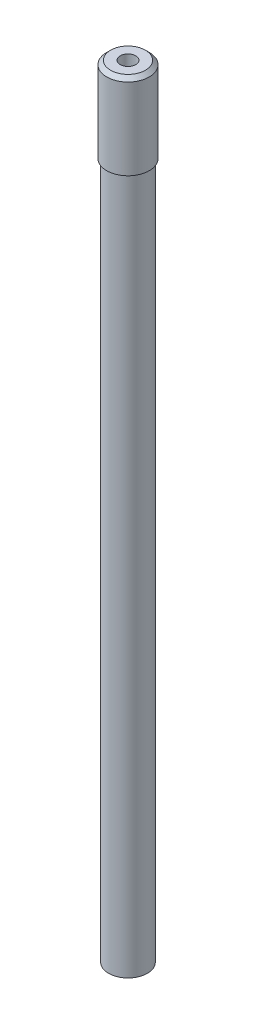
ISO-10303-21;
HEADER;
FILE_DESCRIPTION(('STEP AP214'),'2;1');
FILE_NAME('part.step','',(''),(''),'','','');
FILE_SCHEMA(('AUTOMOTIVE_DESIGN { 1 0 10303 214 1 1 1 1 }'));
ENDSEC;
DATA;
#1=APPLICATION_CONTEXT('core data for automotive mechanical design processes');
#2=APPLICATION_PROTOCOL_DEFINITION('international standard','automotive_design',2000,#1);
#3=PRODUCT_CONTEXT('',#1,'mechanical');
#4=PRODUCT('Part','Part','',(#3));
#5=PRODUCT_RELATED_PRODUCT_CATEGORY('part','',(#4));
#6=PRODUCT_DEFINITION_FORMATION('','',#4);
#7=PRODUCT_DEFINITION_CONTEXT('part definition',#1,'design');
#8=PRODUCT_DEFINITION('design','',#6,#7);
#9=PRODUCT_DEFINITION_SHAPE('','',#8);
#10=(LENGTH_UNIT() NAMED_UNIT(*) SI_UNIT(.MILLI.,.METRE.));
#11=(NAMED_UNIT(*) PLANE_ANGLE_UNIT() SI_UNIT($,.RADIAN.));
#12=(NAMED_UNIT(*) SI_UNIT($,.STERADIAN.) SOLID_ANGLE_UNIT());
#13=UNCERTAINTY_MEASURE_WITH_UNIT(LENGTH_MEASURE(1.E-05),#10,'distance_accuracy_value','');
#14=(GEOMETRIC_REPRESENTATION_CONTEXT(3) GLOBAL_UNCERTAINTY_ASSIGNED_CONTEXT((#13)) GLOBAL_UNIT_ASSIGNED_CONTEXT((#10,
#11,#12)) REPRESENTATION_CONTEXT('',''));
#15=CARTESIAN_POINT('',(0.,0.,0.));
#16=DIRECTION('',(0.,0.,1.));
#17=DIRECTION('',(1.,0.,0.));
#18=AXIS2_PLACEMENT_3D('',#15,#16,#17);
#19=CARTESIAN_POINT('',(0.,0.,0.));
#20=DIRECTION('',(0.,1.,0.));
#21=DIRECTION('',(0.,0.,1.));
#22=AXIS2_PLACEMENT_3D('',#19,#20,#21);
#23=PLANE('',#22);
#24=CARTESIAN_POINT('',(0.,0.,0.));
#25=DIRECTION('',(0.,1.,0.));
#26=DIRECTION('',(0.,0.,1.));
#27=AXIS2_PLACEMENT_3D('',#24,#25,#26);
#28=CIRCLE('',#27,2.75);
#29=CARTESIAN_POINT('',(0.,0.,2.75));
#30=VERTEX_POINT('',#29);
#31=EDGE_CURVE('E45',#30,#30,#28,.T.);
#32=ORIENTED_EDGE('',*,*,#31,.F.);
#33=EDGE_LOOP('',(#32));
#34=FACE_BOUND('',#33,.T.);
#35=CARTESIAN_POINT('',(0.,0.,0.));
#36=DIRECTION('',(0.,1.,0.));
#37=DIRECTION('',(0.,0.,1.));
#38=AXIS2_PLACEMENT_3D('',#35,#36,#37);
#39=CIRCLE('',#38,2.5);
#40=CARTESIAN_POINT('',(0.,0.,2.5));
#41=VERTEX_POINT('',#40);
#42=EDGE_CURVE('E10',#41,#41,#39,.F.);
#43=ORIENTED_EDGE('',*,*,#42,.F.);
#44=EDGE_LOOP('',(#43));
#45=FACE_BOUND('',#44,.T.);
#46=ADVANCED_FACE('F30',(#34,#45),#23,.F.);
#47=CARTESIAN_POINT('',(0.,11.,0.));
#48=DIRECTION('',(0.,-1.,0.));
#49=DIRECTION('',(0.,0.,-1.));
#50=AXIS2_PLACEMENT_3D('',#47,#48,#49);
#51=CYLINDRICAL_SURFACE('',#50,2.75);
#52=CARTESIAN_POINT('',(0.,10.5,0.));
#53=DIRECTION('',(0.,1.,0.));
#54=DIRECTION('',(0.,0.,1.));
#55=AXIS2_PLACEMENT_3D('',#52,#53,#54);
#56=CIRCLE('',#55,2.75);
#57=CARTESIAN_POINT('',(0.,10.5,2.75));
#58=VERTEX_POINT('',#57);
#59=EDGE_CURVE('E37',#58,#58,#56,.F.);
#60=ORIENTED_EDGE('',*,*,#59,.T.);
#61=EDGE_LOOP('',(#60));
#62=FACE_BOUND('',#61,.T.);
#63=ORIENTED_EDGE('',*,*,#31,.T.);
#64=EDGE_LOOP('',(#63));
#65=FACE_BOUND('',#64,.T.);
#66=ADVANCED_FACE('F72',(#62,#65),#51,.T.);
#67=CARTESIAN_POINT('',(0.,11.,0.));
#68=DIRECTION('',(0.,1.,0.));
#69=DIRECTION('',(0.,0.,1.));
#70=AXIS2_PLACEMENT_3D('',#67,#68,#69);
#71=PLANE('',#70);
#72=CARTESIAN_POINT('',(0.,11.,0.));
#73=DIRECTION('',(0.,1.,0.));
#74=DIRECTION('',(0.,0.,1.));
#75=AXIS2_PLACEMENT_3D('',#72,#73,#74);
#76=CIRCLE('',#75,1.);
#77=CARTESIAN_POINT('',(0.,11.,1.));
#78=VERTEX_POINT('',#77);
#79=EDGE_CURVE('E54',#78,#78,#76,.T.);
#80=ORIENTED_EDGE('',*,*,#79,.F.);
#81=EDGE_LOOP('',(#80));
#82=FACE_BOUND('',#81,.T.);
#83=CARTESIAN_POINT('',(0.,11.,0.));
#84=DIRECTION('',(0.,1.,0.));
#85=DIRECTION('',(0.,0.,1.));
#86=AXIS2_PLACEMENT_3D('',#83,#84,#85);
#87=CIRCLE('',#86,2.25);
#88=CARTESIAN_POINT('',(0.,11.,2.25));
#89=VERTEX_POINT('',#88);
#90=EDGE_CURVE('E41',#89,#89,#87,.T.);
#91=ORIENTED_EDGE('',*,*,#90,.T.);
#92=EDGE_LOOP('',(#91));
#93=FACE_BOUND('',#92,.T.);
#94=ADVANCED_FACE('F69',(#82,#93),#71,.T.);
#95=CARTESIAN_POINT('',(0.,11.,0.));
#96=DIRECTION('',(0.,-1.,0.));
#97=DIRECTION('',(0.,0.,-1.));
#98=AXIS2_PLACEMENT_3D('',#95,#96,#97);
#99=CONICAL_SURFACE('',#98,2.25,0.785398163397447);
#100=ORIENTED_EDGE('',*,*,#59,.F.);
#101=EDGE_LOOP('',(#100));
#102=FACE_BOUND('',#101,.T.);
#103=ORIENTED_EDGE('',*,*,#90,.F.);
#104=EDGE_LOOP('',(#103));
#105=FACE_BOUND('',#104,.T.);
#106=ADVANCED_FACE('F32',(#102,#105),#99,.T.);
#107=CARTESIAN_POINT('',(0.,-90.,0.));
#108=DIRECTION('',(0.,1.,0.));
#109=DIRECTION('',(0.,0.,1.));
#110=AXIS2_PLACEMENT_3D('',#107,#108,#109);
#111=CYLINDRICAL_SURFACE('',#110,2.5);
#112=CARTESIAN_POINT('',(0.,-90.,0.));
#113=DIRECTION('',(0.,-1.,0.));
#114=DIRECTION('',(0.,0.,-1.));
#115=AXIS2_PLACEMENT_3D('',#112,#113,#114);
#116=CIRCLE('',#115,2.5);
#117=CARTESIAN_POINT('',(0.,-90.,2.5));
#118=VERTEX_POINT('',#117);
#119=EDGE_CURVE('E50',#118,#118,#116,.T.);
#120=CARTESIAN_POINT('',(0.,-90.,2.5));
#121=CARTESIAN_POINT('',(0.,-89.0625,2.5));
#122=CARTESIAN_POINT('',(0.,-88.125,2.5));
#123=CARTESIAN_POINT('',(0.,-86.25,2.5));
#124=CARTESIAN_POINT('',(0.,-85.3125,2.5));
#125=CARTESIAN_POINT('',(0.,-83.4375,2.5));
#126=CARTESIAN_POINT('',(0.,-82.5,2.5));
#127=CARTESIAN_POINT('',(0.,-80.625,2.5));
#128=CARTESIAN_POINT('',(0.,-79.6875,2.5));
#129=CARTESIAN_POINT('',(0.,-77.8125,2.5));
#130=CARTESIAN_POINT('',(0.,-76.875,2.5));
#131=CARTESIAN_POINT('',(0.,-75.,2.5));
#132=CARTESIAN_POINT('',(0.,-74.0625,2.5));
#133=CARTESIAN_POINT('',(0.,-72.1875,2.5));
#134=CARTESIAN_POINT('',(0.,-71.25,2.5));
#135=CARTESIAN_POINT('',(0.,-69.375,2.5));
#136=CARTESIAN_POINT('',(0.,-68.4375,2.5));
#137=CARTESIAN_POINT('',(0.,-66.5625,2.5));
#138=CARTESIAN_POINT('',(0.,-65.625,2.5));
#139=CARTESIAN_POINT('',(0.,-63.75,2.5));
#140=CARTESIAN_POINT('',(0.,-62.8125,2.5));
#141=CARTESIAN_POINT('',(0.,-60.9375,2.5));
#142=CARTESIAN_POINT('',(0.,-60.,2.5));
#143=CARTESIAN_POINT('',(0.,-58.125,2.5));
#144=CARTESIAN_POINT('',(0.,-57.1875,2.5));
#145=CARTESIAN_POINT('',(0.,-55.3125,2.5));
#146=CARTESIAN_POINT('',(0.,-54.375,2.5));
#147=CARTESIAN_POINT('',(0.,-52.5,2.5));
#148=CARTESIAN_POINT('',(0.,-51.5625,2.5));
#149=CARTESIAN_POINT('',(0.,-49.6875,2.5));
#150=CARTESIAN_POINT('',(0.,-48.75,2.5));
#151=CARTESIAN_POINT('',(0.,-46.875,2.5));
#152=CARTESIAN_POINT('',(0.,-45.9375,2.5));
#153=CARTESIAN_POINT('',(0.,-44.0625,2.5));
#154=CARTESIAN_POINT('',(0.,-43.125,2.5));
#155=CARTESIAN_POINT('',(0.,-41.25,2.5));
#156=CARTESIAN_POINT('',(0.,-40.3125,2.5));
#157=CARTESIAN_POINT('',(0.,-38.4375,2.5));
#158=CARTESIAN_POINT('',(0.,-37.5,2.5));
#159=CARTESIAN_POINT('',(0.,-35.625,2.5));
#160=CARTESIAN_POINT('',(0.,-34.6875,2.5));
#161=CARTESIAN_POINT('',(0.,-32.8125,2.5));
#162=CARTESIAN_POINT('',(0.,-31.875,2.5));
#163=CARTESIAN_POINT('',(0.,-30.,2.5));
#164=CARTESIAN_POINT('',(0.,-29.0625,2.5));
#165=CARTESIAN_POINT('',(0.,-27.1875,2.5));
#166=CARTESIAN_POINT('',(0.,-26.25,2.5));
#167=CARTESIAN_POINT('',(0.,-24.375,2.5));
#168=CARTESIAN_POINT('',(0.,-23.4375,2.5));
#169=CARTESIAN_POINT('',(0.,-21.5625,2.5));
#170=CARTESIAN_POINT('',(0.,-20.625,2.5));
#171=CARTESIAN_POINT('',(0.,-18.75,2.5));
#172=CARTESIAN_POINT('',(0.,-17.8125,2.5));
#173=CARTESIAN_POINT('',(0.,-15.9375,2.5));
#174=CARTESIAN_POINT('',(0.,-15.,2.5));
#175=CARTESIAN_POINT('',(0.,-13.125,2.5));
#176=CARTESIAN_POINT('',(0.,-12.1875,2.5));
#177=CARTESIAN_POINT('',(0.,-10.3125,2.5));
#178=CARTESIAN_POINT('',(0.,-9.37500000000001,2.5));
#179=CARTESIAN_POINT('',(0.,-7.50000000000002,2.5));
#180=CARTESIAN_POINT('',(0.,-6.56250000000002,2.5));
#181=CARTESIAN_POINT('',(0.,-4.68750000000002,2.5));
#182=CARTESIAN_POINT('',(0.,-3.75000000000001,2.5));
#183=CARTESIAN_POINT('',(0.,-1.87500000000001,2.5));
#184=CARTESIAN_POINT('',(0.,-0.937500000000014,2.5));
#185=CARTESIAN_POINT('',(0.,0.,2.5));
#186=B_SPLINE_CURVE_WITH_KNOTS('',3,(#120,#121,#122,#123,#124,#125,#126,#127,#128,#129,#130,
#131,#132,#133,#134,#135,#136,#137,#138,#139,#140,#141,#142,#143,#144,#145,#146,#147,#148,#149,
#150,#151,#152,#153,#154,#155,#156,#157,#158,#159,#160,#161,#162,#163,#164,#165,#166,#167,#168,
#169,#170,#171,#172,#173,#174,#175,#176,#177,#178,#179,#180,#181,#182,#183,#184,#185),
.UNSPECIFIED.,.F.,.F.,(4,2,2,2,2,2,2,2,2,2,2,2,2,2,2,2,2,2,2,2,2,2,2,2,2,2,2,2,2,2,2,2,4),(0.,
2.81250000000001,5.62500000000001,8.4375,11.25,14.0625,16.875,19.6875,22.5,25.3125,28.125,
30.9375,33.75,36.5625,39.375,42.1875,45.,47.8125,50.625,53.4375,56.25,59.0625,61.875,64.6875,
67.5,70.3125,73.125,75.9375,78.75,81.5625,84.375,87.1875,90.),.UNSPECIFIED.);
#187=EDGE_CURVE('BSEAM77',#118,#41,#186,.T.);
#188=ORIENTED_EDGE('',*,*,#119,.F.);
#189=ORIENTED_EDGE('',*,*,#42,.T.);
#190=ORIENTED_EDGE('',*,*,#187,.T.);
#191=ORIENTED_EDGE('',*,*,#187,.F.);
#192=EDGE_LOOP('',(#188,#190,#189,#191));
#193=FACE_BOUND('',#192,.T.);
#194=ADVANCED_FACE('F77',(#193),#111,.T.);
#195=CARTESIAN_POINT('',(0.,-90.,0.));
#196=DIRECTION('',(0.,-1.,0.));
#197=DIRECTION('',(0.,0.,-1.));
#198=AXIS2_PLACEMENT_3D('',#195,#196,#197);
#199=PLANE('',#198);
#200=CARTESIAN_POINT('',(0.,-90.,0.));
#201=DIRECTION('',(0.,1.,0.));
#202=DIRECTION('',(0.,0.,1.));
#203=AXIS2_PLACEMENT_3D('',#200,#201,#202);
#204=CIRCLE('',#203,1.);
#205=CARTESIAN_POINT('',(0.,-90.,1.));
#206=VERTEX_POINT('',#205);
#207=EDGE_CURVE('E53',#206,#206,#204,.T.);
#208=ORIENTED_EDGE('',*,*,#207,.T.);
#209=EDGE_LOOP('',(#208));
#210=FACE_BOUND('',#209,.T.);
#211=ORIENTED_EDGE('',*,*,#119,.T.);
#212=EDGE_LOOP('',(#211));
#213=FACE_BOUND('',#212,.T.);
#214=ADVANCED_FACE('F60',(#210,#213),#199,.T.);
#215=CARTESIAN_POINT('',(0.,-90.,0.));
#216=DIRECTION('',(0.,1.,0.));
#217=DIRECTION('',(0.,0.,1.));
#218=AXIS2_PLACEMENT_3D('',#215,#216,#217);
#219=CYLINDRICAL_SURFACE('',#218,1.);
#220=CARTESIAN_POINT('',(0.,-90.,1.));
#221=CARTESIAN_POINT('',(0.,-88.9479166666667,1.));
#222=CARTESIAN_POINT('',(0.,-87.8958333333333,1.));
#223=CARTESIAN_POINT('',(0.,-85.7916666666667,1.));
#224=CARTESIAN_POINT('',(0.,-84.7395833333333,1.));
#225=CARTESIAN_POINT('',(0.,-82.6354166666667,1.));
#226=CARTESIAN_POINT('',(0.,-81.5833333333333,1.));
#227=CARTESIAN_POINT('',(0.,-79.4791666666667,1.));
#228=CARTESIAN_POINT('',(0.,-78.4270833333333,1.));
#229=CARTESIAN_POINT('',(0.,-76.3229166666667,1.));
#230=CARTESIAN_POINT('',(0.,-75.2708333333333,1.));
#231=CARTESIAN_POINT('',(0.,-73.1666666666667,1.));
#232=CARTESIAN_POINT('',(0.,-72.1145833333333,1.));
#233=CARTESIAN_POINT('',(0.,-70.0104166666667,1.));
#234=CARTESIAN_POINT('',(0.,-68.9583333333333,1.));
#235=CARTESIAN_POINT('',(0.,-66.8541666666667,1.));
#236=CARTESIAN_POINT('',(0.,-65.8020833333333,1.));
#237=CARTESIAN_POINT('',(0.,-63.6979166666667,1.));
#238=CARTESIAN_POINT('',(0.,-62.6458333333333,1.));
#239=CARTESIAN_POINT('',(0.,-60.5416666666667,1.));
#240=CARTESIAN_POINT('',(0.,-59.4895833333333,1.));
#241=CARTESIAN_POINT('',(0.,-57.3854166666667,1.));
#242=CARTESIAN_POINT('',(0.,-56.3333333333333,1.));
#243=CARTESIAN_POINT('',(0.,-54.2291666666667,1.));
#244=CARTESIAN_POINT('',(0.,-53.1770833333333,1.));
#245=CARTESIAN_POINT('',(0.,-51.0729166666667,1.));
#246=CARTESIAN_POINT('',(0.,-50.0208333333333,1.));
#247=CARTESIAN_POINT('',(0.,-47.9166666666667,1.));
#248=CARTESIAN_POINT('',(0.,-46.8645833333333,1.));
#249=CARTESIAN_POINT('',(0.,-44.7604166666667,1.));
#250=CARTESIAN_POINT('',(0.,-43.7083333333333,1.));
#251=CARTESIAN_POINT('',(0.,-41.6041666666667,1.));
#252=CARTESIAN_POINT('',(0.,-40.5520833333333,1.));
#253=CARTESIAN_POINT('',(0.,-38.4479166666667,1.));
#254=CARTESIAN_POINT('',(0.,-37.3958333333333,1.));
#255=CARTESIAN_POINT('',(0.,-35.2916666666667,1.));
#256=CARTESIAN_POINT('',(0.,-34.2395833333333,1.));
#257=CARTESIAN_POINT('',(0.,-32.1354166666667,1.));
#258=CARTESIAN_POINT('',(0.,-31.0833333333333,1.));
#259=CARTESIAN_POINT('',(0.,-28.9791666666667,1.));
#260=CARTESIAN_POINT('',(0.,-27.9270833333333,1.));
#261=CARTESIAN_POINT('',(0.,-25.8229166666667,1.));
#262=CARTESIAN_POINT('',(0.,-24.7708333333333,1.));
#263=CARTESIAN_POINT('',(0.,-22.6666666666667,1.));
#264=CARTESIAN_POINT('',(0.,-21.6145833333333,1.));
#265=CARTESIAN_POINT('',(0.,-19.5104166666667,1.));
#266=CARTESIAN_POINT('',(0.,-18.4583333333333,1.));
#267=CARTESIAN_POINT('',(0.,-16.3541666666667,1.));
#268=CARTESIAN_POINT('',(0.,-15.3020833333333,1.));
#269=CARTESIAN_POINT('',(0.,-13.1979166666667,1.));
#270=CARTESIAN_POINT('',(0.,-12.1458333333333,1.));
#271=CARTESIAN_POINT('',(0.,-10.0416666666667,1.));
#272=CARTESIAN_POINT('',(0.,-8.98958333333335,1.));
#273=CARTESIAN_POINT('',(0.,-6.88541666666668,1.));
#274=CARTESIAN_POINT('',(0.,-5.83333333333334,1.));
#275=CARTESIAN_POINT('',(0.,-3.72916666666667,1.));
#276=CARTESIAN_POINT('',(0.,-2.67708333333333,1.));
#277=CARTESIAN_POINT('',(0.,-0.572916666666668,1.));
#278=CARTESIAN_POINT('',(0.,0.479166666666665,1.));
#279=CARTESIAN_POINT('',(0.,2.58333333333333,1.));
#280=CARTESIAN_POINT('',(0.,3.63541666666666,1.));
#281=CARTESIAN_POINT('',(0.,5.73958333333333,1.));
#282=CARTESIAN_POINT('',(0.,6.79166666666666,1.));
#283=CARTESIAN_POINT('',(0.,8.89583333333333,1.));
#284=CARTESIAN_POINT('',(0.,9.94791666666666,1.));
#285=CARTESIAN_POINT('',(0.,11.,1.));
#286=B_SPLINE_CURVE_WITH_KNOTS('',3,(#220,#221,#222,#223,#224,#225,#226,#227,#228,#229,#230,
#231,#232,#233,#234,#235,#236,#237,#238,#239,#240,#241,#242,#243,#244,#245,#246,#247,#248,#249,
#250,#251,#252,#253,#254,#255,#256,#257,#258,#259,#260,#261,#262,#263,#264,#265,#266,#267,#268,
#269,#270,#271,#272,#273,#274,#275,#276,#277,#278,#279,#280,#281,#282,#283,#284,#285),
.UNSPECIFIED.,.F.,.F.,(4,2,2,2,2,2,2,2,2,2,2,2,2,2,2,2,2,2,2,2,2,2,2,2,2,2,2,2,2,2,2,2,4),(0.,
3.15625000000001,6.31250000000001,9.46875000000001,12.625,15.78125,18.9375,22.09375,25.25,
28.40625,31.5625,34.71875,37.875,41.03125,44.1875,47.34375,50.5,53.65625,56.8125,59.96875,
63.125,66.28125,69.4375,72.59375,75.75,78.90625,82.0625,85.21875,88.375,91.53125,94.6875,
97.84375,101.),.UNSPECIFIED.);
#287=EDGE_CURVE('BSEAM63',#206,#78,#286,.T.);
#288=ORIENTED_EDGE('',*,*,#207,.F.);
#289=ORIENTED_EDGE('',*,*,#79,.T.);
#290=ORIENTED_EDGE('',*,*,#287,.T.);
#291=ORIENTED_EDGE('',*,*,#287,.F.);
#292=EDGE_LOOP('',(#288,#290,#289,#291));
#293=FACE_BOUND('',#292,.T.);
#294=ADVANCED_FACE('F63',(#293),#219,.F.);
#295=CLOSED_SHELL('',(#46,#66,#94,#106,#194,#214,#294));
#296=MANIFOLD_SOLID_BREP('B2',#295);
#297=ADVANCED_BREP_SHAPE_REPRESENTATION('',(#18,#296),#14);
#298=SHAPE_DEFINITION_REPRESENTATION(#9,#297);
ENDSEC;
END-ISO-10303-21;
